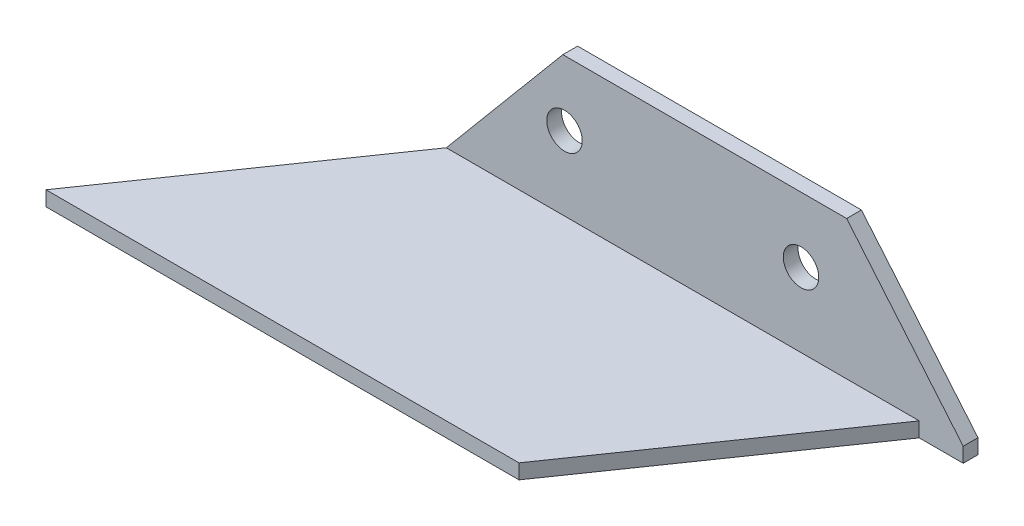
from build123d import *

# Parameters (mm, degrees)
BOSS_EXTRUDE1_DEPTH = 3.175
MT_FLANGE_DEPTH     = 3.175
SKETCH4_R           = 3.81
HOLES_DEPTH         = 160.324611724


with BuildPart() as part:
    # Sketch1 → Boss-Extrude1 (new body)
    with BuildSketch(Plane(origin=(0, 0, 0), x_dir=(1, 0, 0), z_dir=(0, 1, 0))):
        Polygon((0, 0), (35.175587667, 50.8), (136.775587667, 50.8), (101.6, 0), align=None)
    extrude(amount=BOSS_EXTRUDE1_DEPTH)

    # Sketch3 → mt flange (add)
    with BuildSketch(Plane(origin=(0, 0, -50.8), x_dir=(-1, 0, 0), z_dir=(0, 0, -1))):
        Polygon((-35.175587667, 3.175), (-60.21851616, 33.02), (-121.17851616, 33.02), (-146.221444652, 3.175), (-146.221444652, 0), (-35.175587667, 0), align=None)
    extrude(amount=MT_FLANGE_DEPTH)

    # Sketch4 → holes (cut, through all)
    with BuildSketch(Plane(origin=(0, 0, -53.975), x_dir=(-1, 0, 0), z_dir=(0, 0, -1))):
        with Locations((-60.575587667, 19.05)):
            Circle(SKETCH4_R)
        with Locations((-111.375587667, 19.05)):
            Circle(SKETCH4_R)
    extrude(amount=-HOLES_DEPTH, mode=Mode.SUBTRACT)


solid = part.part
